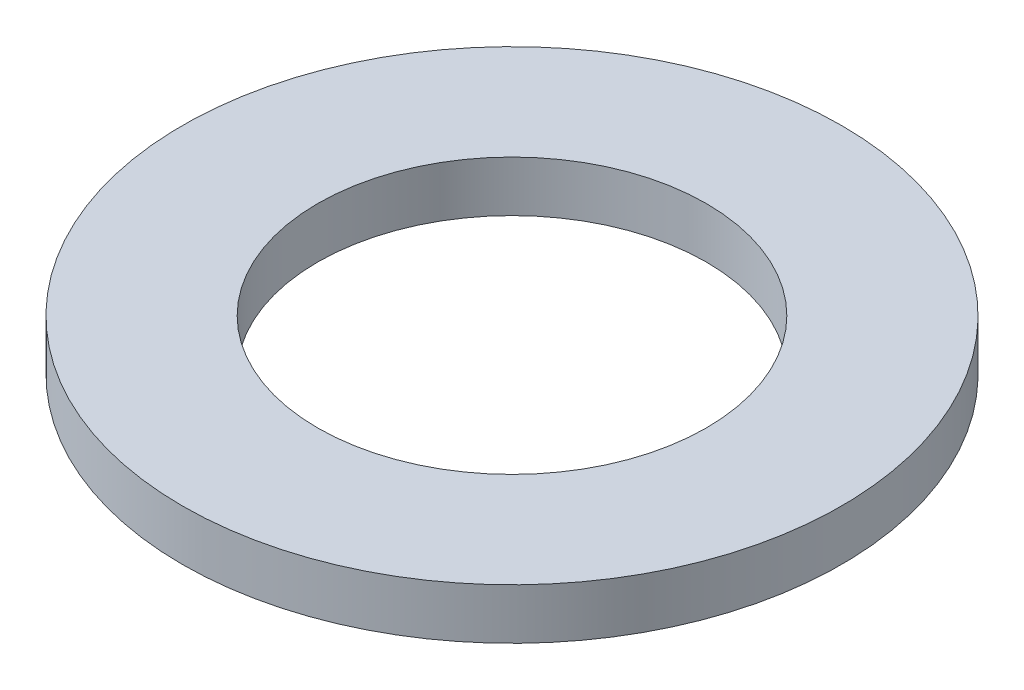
from build123d import *

# Parameters (mm, degrees)
SKETCH1_R      = 19.5
SKETCH1_R_2    = 11.5
EXTRUDE1_DEPTH = 3


with BuildPart() as part:
    # Sketch1 → Extrude1 (new body)
    with BuildSketch(Plane(origin=(0, 0, 0), x_dir=(1, 0, 0), z_dir=(0, 1, 0))):
        with Locations(Location((0, 0, 0), (0, 0, 270))):
            Circle(SKETCH1_R)
        with Locations(Location((0, 0, 0), (0, 0, 270))):
            Circle(SKETCH1_R_2, mode=Mode.SUBTRACT)
    extrude(amount=EXTRUDE1_DEPTH)


solid = part.part
